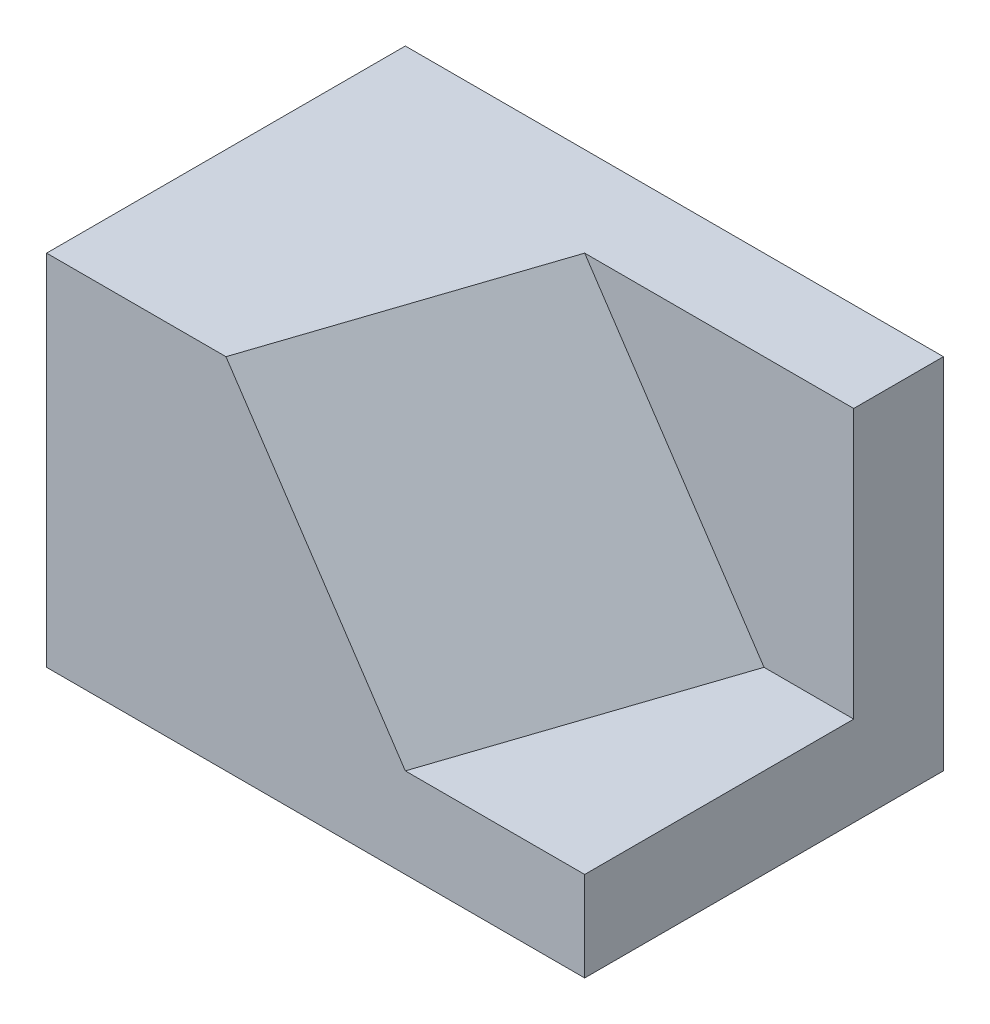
from build123d import *

# Parameters (mm, degrees)
EXTRUDE1_DEPTH      = 30
EXTRUDE1_DEPTH_BACK = 10
SKETCH1_W           = 60
SKETCH1_H           = 40


with BuildPart() as part:
    # Sketch1 → Extrude1 (new, two sides: drawn at the far end of the back side and taken through both)
    with BuildSketch(Plane(origin=(0, 0, 0), x_dir=(1, 0, 0), z_dir=(0, 1, 0)).offset(-EXTRUDE1_DEPTH_BACK)):
        with Locations((30, 20)):
            Rectangle(SKETCH1_W, SKETCH1_H)
    extrude(amount=EXTRUDE1_DEPTH + EXTRUDE1_DEPTH_BACK)

    # Sketch2 → Cut-Loft1 section 0
    with BuildSketch(Plane(origin=(0, 30, 0), x_dir=(1, 0, 0), z_dir=(0, 1, 0))):
        with BuildLine():
            Line((60, 30), (30, 30))
            Line((30, 30), (20, 0))
            Line((20, 0), (60, 0))
            Line((60, 0), (60, 30))
        make_face()
    # Sketch3 → Cut-Loft1 section 1
    with BuildSketch(Plane(origin=(0, 0, 0), x_dir=(1, 0, 0), z_dir=(0, 1, 0))):
        with BuildLine():
            Line((60, 0), (40, 0))
            Line((40, 0), (50, 30))
            Line((50, 30), (60, 30))
            Line((60, 30), (60, 0))
        make_face()
    loft(mode=Mode.SUBTRACT)


solid = part.part
